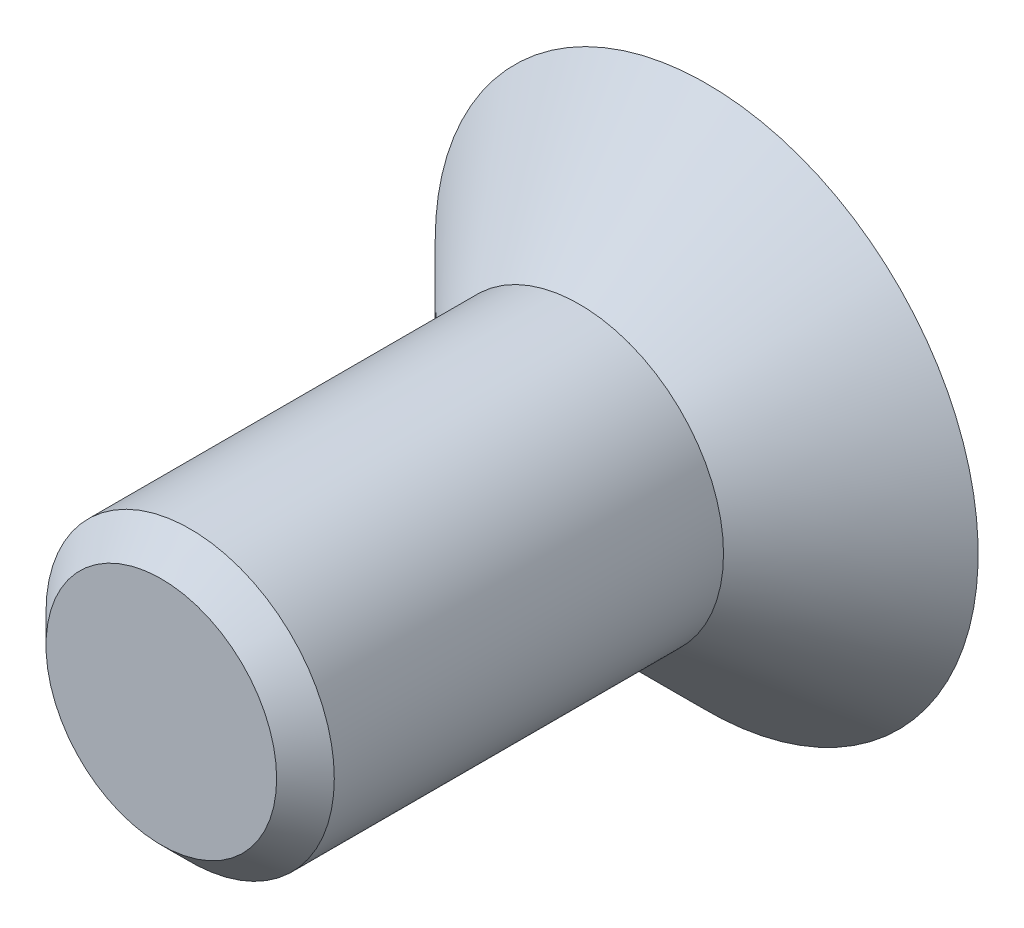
from build123d import *

# Parameters (mm, degrees)
FENTE1_DEPTH    = 2.8
ESQUISSE3_W     = 3
ESQUISSE3_H     = 8.7
CHANFREIN1_SIZE = 0.6


with BuildPart() as part:
    # Esquisse1 → Base-R_volution (revolve)
    with BuildSketch(Plane(origin=(0, 0, 0), x_dir=(1, 0, 0), z_dir=(0, 1, 0)), mode=Mode.PRIVATE) as base_r_volution_sk:
        Polygon((3, 0), (5.65, 2.65), (0, 2.65), (0, 0), align=None)
    revolve(base_r_volution_sk.sketch.rotate(Axis((0, 0, 0), (0, 0, -1)), 180), axis=Axis((0, 0, 0), (0, 0, -1)))

    # Esquisse2 → fente1 (cut)
    with BuildSketch(Plane.XY.offset(-2.65)):
        Polygon((2, -1.154700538), (2, 1.154700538), (0, 2.309401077), (-2, 1.154700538), (-2, -1.154700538), (0, -2.309401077), align=None)
    extrude(amount=FENTE1_DEPTH, mode=Mode.SUBTRACT)

    # Esquisse3 → Boss.-R_vol.1 (revolve)
    with BuildSketch(Plane(origin=(0, 0, 0), x_dir=(1, 0, 0), z_dir=(0, 1, 0))):
        with Locations((1.5, -4.35)):
            Rectangle(ESQUISSE3_W, ESQUISSE3_H)
    revolve(axis=Axis((0, 0, 0), (0, 0, 1)))

    # Chanfrein1
    chanfrein1_edges = [part.edges().sort_by_distance(p)[0] for p in [
        (-3, 0, 8.7),
    ]]
    chamfer(chanfrein1_edges, length=CHANFREIN1_SIZE)


solid = part.part
